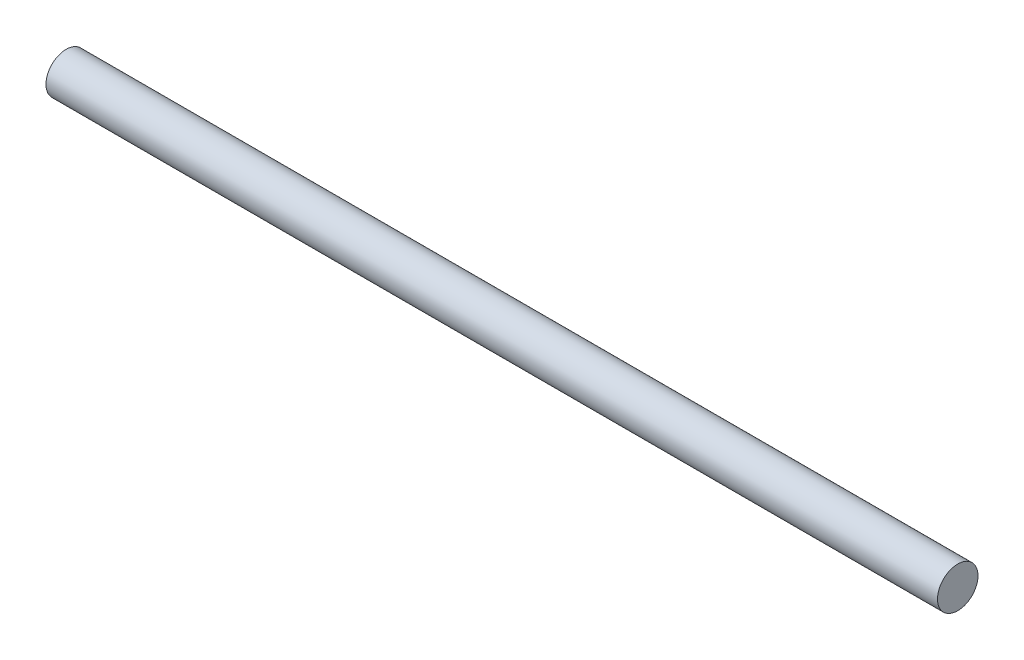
ISO-10303-21;
HEADER;
FILE_DESCRIPTION(('STEP AP214'),'2;1');
FILE_NAME('part.step','',(''),(''),'','','');
FILE_SCHEMA(('AUTOMOTIVE_DESIGN { 1 0 10303 214 1 1 1 1 }'));
ENDSEC;
DATA;
#1=APPLICATION_CONTEXT('core data for automotive mechanical design processes');
#2=APPLICATION_PROTOCOL_DEFINITION('international standard','automotive_design',2000,#1);
#3=PRODUCT_CONTEXT('',#1,'mechanical');
#4=PRODUCT('Part','Part','',(#3));
#5=PRODUCT_RELATED_PRODUCT_CATEGORY('part','',(#4));
#6=PRODUCT_DEFINITION_FORMATION('','',#4);
#7=PRODUCT_DEFINITION_CONTEXT('part definition',#1,'design');
#8=PRODUCT_DEFINITION('design','',#6,#7);
#9=PRODUCT_DEFINITION_SHAPE('','',#8);
#10=(LENGTH_UNIT() NAMED_UNIT(*) SI_UNIT(.MILLI.,.METRE.));
#11=(NAMED_UNIT(*) PLANE_ANGLE_UNIT() SI_UNIT($,.RADIAN.));
#12=(NAMED_UNIT(*) SI_UNIT($,.STERADIAN.) SOLID_ANGLE_UNIT());
#13=UNCERTAINTY_MEASURE_WITH_UNIT(LENGTH_MEASURE(1.E-05),#10,'distance_accuracy_value','');
#14=(GEOMETRIC_REPRESENTATION_CONTEXT(3) GLOBAL_UNCERTAINTY_ASSIGNED_CONTEXT((#13)) GLOBAL_UNIT_ASSIGNED_CONTEXT((#10,
#11,#12)) REPRESENTATION_CONTEXT('',''));
#15=CARTESIAN_POINT('',(0.,0.,0.));
#16=DIRECTION('',(0.,0.,1.));
#17=DIRECTION('',(1.,0.,0.));
#18=AXIS2_PLACEMENT_3D('',#15,#16,#17);
#19=CARTESIAN_POINT('',(220.,0.,0.));
#20=DIRECTION('',(-1.,0.,0.));
#21=DIRECTION('',(0.,0.,1.));
#22=AXIS2_PLACEMENT_3D('',#19,#20,#21);
#23=CYLINDRICAL_SURFACE('',#22,5.);
#24=CARTESIAN_POINT('',(220.,0.,0.));
#25=DIRECTION('',(1.,0.,0.));
#26=DIRECTION('',(0.,0.,-1.));
#27=AXIS2_PLACEMENT_3D('',#24,#25,#26);
#28=CIRCLE('',#27,5.);
#29=CARTESIAN_POINT('',(220.,0.,-5.));
#30=VERTEX_POINT('',#29);
#31=EDGE_CURVE('E10',#30,#30,#28,.T.);
#32=ORIENTED_EDGE('',*,*,#31,.F.);
#33=EDGE_LOOP('',(#32));
#34=FACE_BOUND('',#33,.T.);
#35=CARTESIAN_POINT('',(0.,0.,0.));
#36=DIRECTION('',(1.,0.,0.));
#37=DIRECTION('',(0.,0.,-1.));
#38=AXIS2_PLACEMENT_3D('',#35,#36,#37);
#39=CIRCLE('',#38,5.);
#40=CARTESIAN_POINT('',(0.,0.,-5.));
#41=VERTEX_POINT('',#40);
#42=EDGE_CURVE('E34',#41,#41,#39,.T.);
#43=ORIENTED_EDGE('',*,*,#42,.T.);
#44=EDGE_LOOP('',(#43));
#45=FACE_BOUND('',#44,.T.);
#46=ADVANCED_FACE('F31',(#34,#45),#23,.T.);
#47=CARTESIAN_POINT('',(220.,0.,0.));
#48=DIRECTION('',(1.,0.,0.));
#49=DIRECTION('',(0.,0.,-1.));
#50=AXIS2_PLACEMENT_3D('',#47,#48,#49);
#51=PLANE('',#50);
#52=ORIENTED_EDGE('',*,*,#31,.T.);
#53=EDGE_LOOP('',(#52));
#54=FACE_BOUND('',#53,.T.);
#55=ADVANCED_FACE('F46',(#54),#51,.T.);
#56=CARTESIAN_POINT('',(0.,0.,0.));
#57=DIRECTION('',(1.,0.,0.));
#58=DIRECTION('',(0.,0.,-1.));
#59=AXIS2_PLACEMENT_3D('',#56,#57,#58);
#60=PLANE('',#59);
#61=ORIENTED_EDGE('',*,*,#42,.F.);
#62=EDGE_LOOP('',(#61));
#63=FACE_BOUND('',#62,.T.);
#64=ADVANCED_FACE('F44',(#63),#60,.F.);
#65=CLOSED_SHELL('',(#46,#55,#64));
#66=MANIFOLD_SOLID_BREP('B2',#65);
#67=ADVANCED_BREP_SHAPE_REPRESENTATION('',(#18,#66),#14);
#68=SHAPE_DEFINITION_REPRESENTATION(#9,#67);
ENDSEC;
END-ISO-10303-21;
